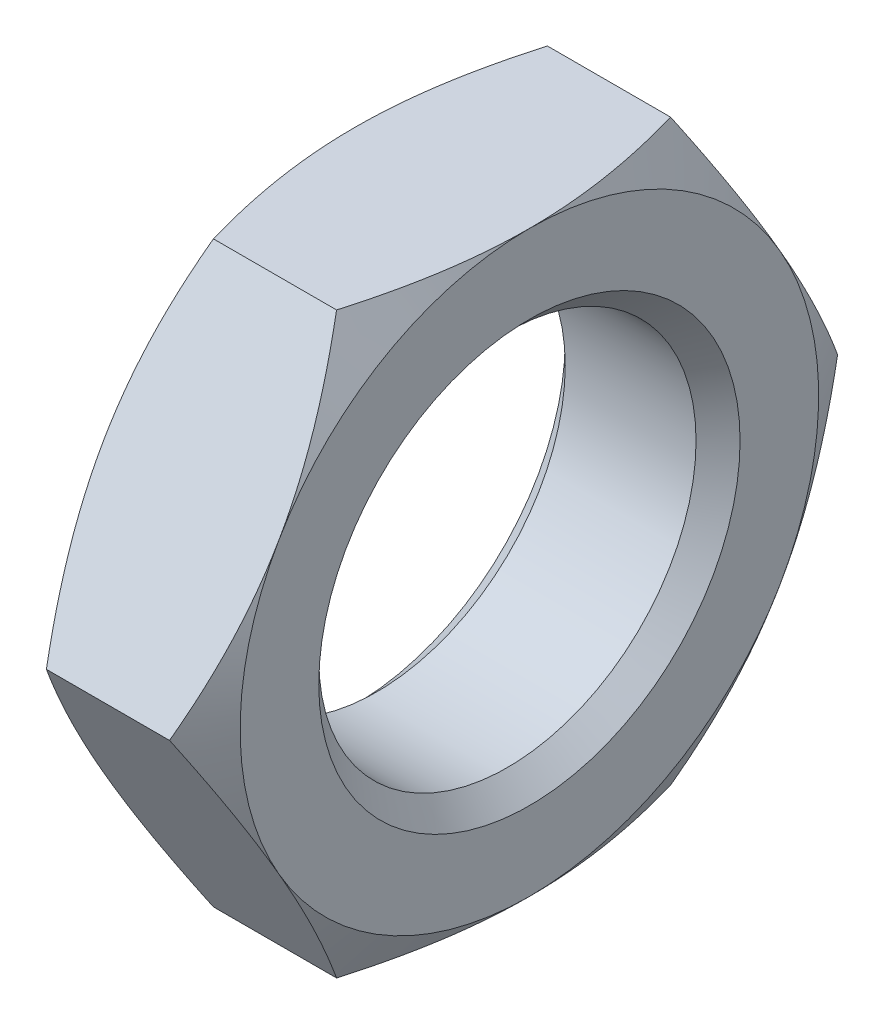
from build123d import *

# Parameters (mm, degrees)
SKETCH1_R      = 15
EXTRUDE1_DEPTH = 13.9
CHAMFER1_SIZE  = 1.75


with BuildPart() as part:
    # Sketch1 → Extrude1 (new body)
    with BuildSketch(Plane(origin=(0, 0, 0), x_dir=(0, 0, -1), z_dir=(1, 0, 0))):
        Polygon((13.279056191, 23), (-13.279056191, 23), (-26.558112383, 0), (-13.279056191, -23), (13.279056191, -23), (26.558112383, 0), align=None)
        Circle(SKETCH1_R, mode=Mode.SUBTRACT)
    extrude(amount=EXTRUDE1_DEPTH)

    # Sketch2 → Cut-Revolve1 (revolve, cut)
    with BuildSketch(Plane.XY):
        Polygon((13.9, 23), (13.9, 92), (0, 92), (0, 23), (6.95, 35.037753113), align=None)
    revolve(axis=Axis((13.9, 0, 0), (-1, 0, 0)), mode=Mode.SUBTRACT)

    # Chamfer1
    chamfer1_edges = [part.edges().sort_by_distance(p)[0] for p in [
        (0, 0, 15),
        (13.9, 0, 15),
    ]]
    chamfer(chamfer1_edges, length=CHAMFER1_SIZE)


solid = part.part
